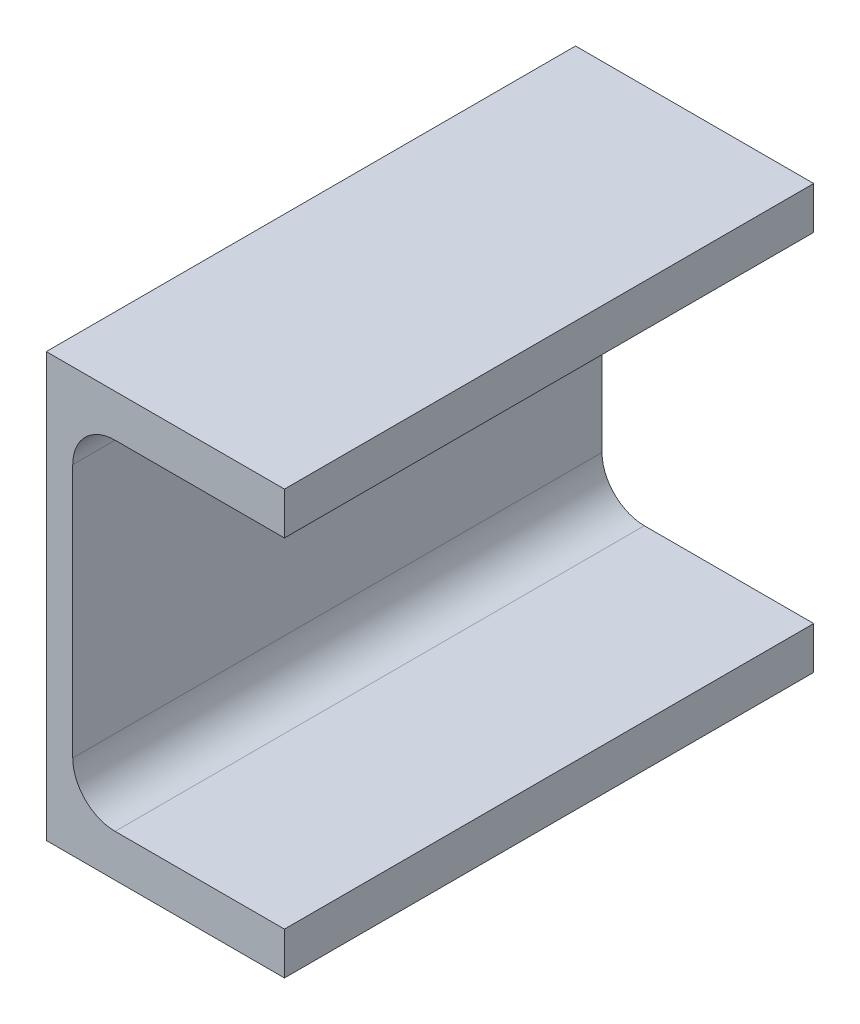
from build123d import *

# Parameters (mm, degrees)
EXTRUDE1_DEPTH = 50


with BuildPart() as part:
    # Sketch1 → Extrude1 (new, symmetric)
    with BuildSketch(Plane.XY):
        with BuildLine():
            Line((45, 40), (0, 40))
            Line((0, 40), (0, -40))
            Line((0, -40), (45, -40))
            Line((45, -40), (45, -32))
            Line((45, -32), (13, -32))
            ThreePointArc((13, -32), (7.343145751, -29.656854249), (5, -24))
            Line((5, -24), (5, 24))
            ThreePointArc((5, 24), (7.343145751, 29.656854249), (13, 32))
            Line((13, 32), (45, 32))
            Line((45, 32), (45, 40))
        make_face()
    extrude(amount=EXTRUDE1_DEPTH, both=True)


solid = part.part
